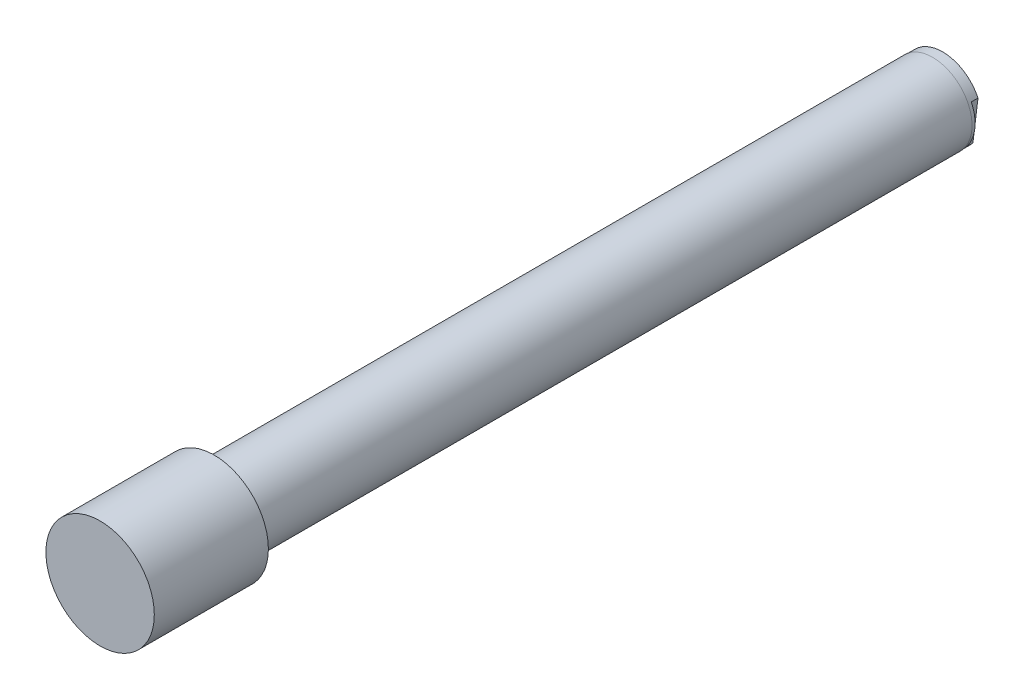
ISO-10303-21;
HEADER;
FILE_DESCRIPTION(('STEP AP214'),'2;1');
FILE_NAME('part.step','',(''),(''),'','','');
FILE_SCHEMA(('AUTOMOTIVE_DESIGN { 1 0 10303 214 1 1 1 1 }'));
ENDSEC;
DATA;
#1=APPLICATION_CONTEXT('core data for automotive mechanical design processes');
#2=APPLICATION_PROTOCOL_DEFINITION('international standard','automotive_design',2000,#1);
#3=PRODUCT_CONTEXT('',#1,'mechanical');
#4=PRODUCT('Part','Part','',(#3));
#5=PRODUCT_RELATED_PRODUCT_CATEGORY('part','',(#4));
#6=PRODUCT_DEFINITION_FORMATION('','',#4);
#7=PRODUCT_DEFINITION_CONTEXT('part definition',#1,'design');
#8=PRODUCT_DEFINITION('design','',#6,#7);
#9=PRODUCT_DEFINITION_SHAPE('','',#8);
#10=(LENGTH_UNIT() NAMED_UNIT(*) SI_UNIT(.MILLI.,.METRE.));
#11=(NAMED_UNIT(*) PLANE_ANGLE_UNIT() SI_UNIT($,.RADIAN.));
#12=(NAMED_UNIT(*) SI_UNIT($,.STERADIAN.) SOLID_ANGLE_UNIT());
#13=UNCERTAINTY_MEASURE_WITH_UNIT(LENGTH_MEASURE(1.E-05),#10,'distance_accuracy_value','');
#14=(GEOMETRIC_REPRESENTATION_CONTEXT(3) GLOBAL_UNCERTAINTY_ASSIGNED_CONTEXT((#13)) GLOBAL_UNIT_ASSIGNED_CONTEXT((#10,
#11,#12)) REPRESENTATION_CONTEXT('',''));
#15=CARTESIAN_POINT('',(0.,0.,0.));
#16=DIRECTION('',(0.,0.,1.));
#17=DIRECTION('',(1.,0.,0.));
#18=AXIS2_PLACEMENT_3D('',#15,#16,#17);
#19=CARTESIAN_POINT('',(0.656038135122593,-5.65517384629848,0.127));
#20=DIRECTION('',(0.,0.,1.));
#21=DIRECTION('',(-0.121869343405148,-0.992546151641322,0.));
#22=AXIS2_PLACEMENT_3D('',#19,#20,#21);
#23=PLANE('',#22);
#24=DIRECTION('',(0.121869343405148,0.992546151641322,0.));
#25=VECTOR('',#24,1.);
#26=CARTESIAN_POINT('',(0.218831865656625,-9.21593316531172,0.127));
#27=LINE('',#26,#25);
#28=CARTESIAN_POINT('',(0.218831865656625,-9.21593316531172,0.127));
#29=VERTEX_POINT('',#28);
#30=CARTESIAN_POINT('',(0.656038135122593,-5.65517384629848,0.127));
#31=VERTEX_POINT('',#30);
#32=EDGE_CURVE('E145',#29,#31,#27,.T.);
#33=ORIENTED_EDGE('',*,*,#32,.F.);
#34=DIRECTION('',(0.999865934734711,-0.016374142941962,0.));
#35=VECTOR('',#34,1.);
#36=CARTESIAN_POINT('',(0.141161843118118,-9.21466121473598,0.127));
#37=LINE('',#36,#35);
#38=CARTESIAN_POINT('',(0.141161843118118,-9.21466121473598,0.127));
#39=VERTEX_POINT('',#38);
#40=EDGE_CURVE('E215',#39,#29,#37,.T.);
#41=ORIENTED_EDGE('',*,*,#40,.F.);
#42=DIRECTION('',(0.229380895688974,-0.973336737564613,0.));
#43=VECTOR('',#42,1.);
#44=CARTESIAN_POINT('',(-0.702419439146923,-5.63507516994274,0.127));
#45=LINE('',#44,#43);
#46=CARTESIAN_POINT('',(-0.702419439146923,-5.63507516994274,0.127));
#47=VERTEX_POINT('',#46);
#48=EDGE_CURVE('E650',#47,#39,#45,.T.);
#49=ORIENTED_EDGE('',*,*,#48,.F.);
#50=DIRECTION('',(0.460532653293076,0.887642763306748,0.));
#51=VECTOR('',#50,1.);
#52=CARTESIAN_POINT('',(-2.39685054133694,-8.90096629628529,0.127));
#53=LINE('',#52,#51);
#54=CARTESIAN_POINT('',(-2.39685054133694,-8.90096629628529,0.127));
#55=VERTEX_POINT('',#54);
#56=EDGE_CURVE('E651',#55,#47,#53,.T.);
#57=ORIENTED_EDGE('',*,*,#56,.F.);
#58=DIRECTION('',(0.97987600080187,-0.199607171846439,0.));
#59=VECTOR('',#58,1.);
#60=CARTESIAN_POINT('',(-2.47344957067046,-8.88536257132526,0.127));
#61=LINE('',#60,#59);
#62=CARTESIAN_POINT('',(-2.47344957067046,-8.88536257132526,0.127));
#63=VERTEX_POINT('',#62);
#64=EDGE_CURVE('E643',#63,#55,#61,.T.);
#65=ORIENTED_EDGE('',*,*,#64,.F.);
#66=DIRECTION('',(-0.121869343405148,-0.992546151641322,0.));
#67=VECTOR('',#66,1.);
#68=CARTESIAN_POINT('',(-2.03624330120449,-5.32460325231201,0.127));
#69=LINE('',#68,#67);
#70=CARTESIAN_POINT('',(-2.03624330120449,-5.32460325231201,0.127));
#71=VERTEX_POINT('',#70);
#72=EDGE_CURVE('E639',#71,#63,#69,.T.);
#73=ORIENTED_EDGE('',*,*,#72,.F.);
#74=DIRECTION('',(-0.992546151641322,0.121869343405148,0.));
#75=VECTOR('',#74,1.);
#76=CARTESIAN_POINT('',(-1.94939551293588,-5.33526681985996,0.127));
#77=LINE('',#76,#75);
#78=CARTESIAN_POINT('',(-1.94939551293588,-5.33526681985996,0.127));
#79=VERTEX_POINT('',#78);
#80=EDGE_CURVE('E656',#79,#71,#77,.T.);
#81=ORIENTED_EDGE('',*,*,#80,.F.);
#82=DIRECTION('',(0.121869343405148,0.992546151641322,0.));
#83=VECTOR('',#82,1.);
#84=CARTESIAN_POINT('',(-2.35344475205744,-8.62598379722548,0.127));
#85=LINE('',#84,#83);
#86=CARTESIAN_POINT('',(-2.35344475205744,-8.62598379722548,0.127));
#87=VERTEX_POINT('',#86);
#88=EDGE_CURVE('E632',#87,#79,#85,.T.);
#89=ORIENTED_EDGE('',*,*,#88,.F.);
#90=DIRECTION('',(-0.460569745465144,-0.88762351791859,0.));
#91=VECTOR('',#90,1.);
#92=CARTESIAN_POINT('',(-0.724027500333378,-5.48572309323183,0.127));
#93=LINE('',#92,#91);
#94=CARTESIAN_POINT('',(-0.724027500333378,-5.48572309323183,0.127));
#95=VERTEX_POINT('',#94);
#96=EDGE_CURVE('E628',#95,#87,#93,.T.);
#97=ORIENTED_EDGE('',*,*,#96,.F.);
#98=DIRECTION('',(-0.992546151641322,0.121869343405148,0.));
#99=VECTOR('',#98,1.);
#100=CARTESIAN_POINT('',(-0.646000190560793,-5.49530364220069,0.127));
#101=LINE('',#100,#99);
#102=CARTESIAN_POINT('',(-0.646000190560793,-5.49530364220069,0.127));
#103=VERTEX_POINT('',#102);
#104=EDGE_CURVE('E660',#103,#95,#101,.T.);
#105=ORIENTED_EDGE('',*,*,#104,.F.);
#106=DIRECTION('',(-0.229507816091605,0.973306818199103,0.));
#107=VECTOR('',#106,1.);
#108=CARTESIAN_POINT('',(0.165141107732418,-8.93522725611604,0.127));
#109=LINE('',#108,#107);
#110=CARTESIAN_POINT('',(0.165141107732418,-8.93522725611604,0.127));
#111=VERTEX_POINT('',#110);
#112=EDGE_CURVE('E662',#111,#103,#109,.T.);
#113=ORIENTED_EDGE('',*,*,#112,.F.);
#114=DIRECTION('',(-0.121869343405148,-0.992546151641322,0.));
#115=VECTOR('',#114,1.);
#116=CARTESIAN_POINT('',(0.569190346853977,-5.64451027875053,0.127));
#117=LINE('',#116,#115);
#118=CARTESIAN_POINT('',(0.569190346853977,-5.64451027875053,0.127));
#119=VERTEX_POINT('',#118);
#120=EDGE_CURVE('E147',#119,#111,#117,.T.);
#121=ORIENTED_EDGE('',*,*,#120,.F.);
#122=DIRECTION('',(-0.992546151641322,0.121869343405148,0.));
#123=VECTOR('',#122,1.);
#124=CARTESIAN_POINT('',(0.656038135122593,-5.65517384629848,0.127));
#125=LINE('',#124,#123);
#126=EDGE_CURVE('E142',#31,#119,#125,.T.);
#127=ORIENTED_EDGE('',*,*,#126,.F.);
#128=EDGE_LOOP('',(#33,#41,#49,#57,#65,#73,#81,#89,#97,#105,#113,#121,#127));
#129=FACE_BOUND('',#128,.T.);
#130=ADVANCED_FACE('F16',(#129),#23,.F.);
#131=CARTESIAN_POINT('',(0.,0.,25.4));
#132=DIRECTION('',(0.,0.,-1.));
#133=DIRECTION('',(0.121869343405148,0.992546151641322,0.));
#134=AXIS2_PLACEMENT_3D('',#131,#132,#133);
#135=CONICAL_SURFACE('',#134,4.4,1.02974425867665);
#136=CARTESIAN_POINT('',(0.,0.,28.0437867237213));
#137=VERTEX_POINT('',#136);
#138=VERTEX_LOOP('',#137);
#139=FACE_BOUND('',#138,.T.);
#140=CARTESIAN_POINT('',(0.,0.,25.4));
#141=DIRECTION('',(0.,0.,-1.));
#142=DIRECTION('',(0.121869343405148,0.992546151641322,0.));
#143=AXIS2_PLACEMENT_3D('',#140,#141,#142);
#144=CIRCLE('',#143,4.4);
#145=CARTESIAN_POINT('',(0.536225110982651,4.36720306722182,25.4));
#146=VERTEX_POINT('',#145);
#147=EDGE_CURVE('E187',#146,#146,#144,.T.);
#148=ORIENTED_EDGE('',*,*,#147,.T.);
#149=EDGE_LOOP('',(#148));
#150=FACE_BOUND('',#149,.T.);
#151=ADVANCED_FACE('F297',(#139,#150),#135,.F.);
#152=CARTESIAN_POINT('',(0.141161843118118,-9.21466121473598,0.127));
#153=DIRECTION('',(0.016374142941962,0.99986593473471,0.));
#154=DIRECTION('',(-0.999865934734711,0.016374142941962,0.));
#155=AXIS2_PLACEMENT_3D('',#152,#153,#154);
#156=PLANE('',#155);
#157=DIRECTION('',(0.999865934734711,-0.016374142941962,0.));
#158=VECTOR('',#157,1.);
#159=CARTESIAN_POINT('',(0.141161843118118,-9.21466121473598,0.));
#160=LINE('',#159,#158);
#161=CARTESIAN_POINT('',(0.141161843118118,-9.21466121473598,0.));
#162=VERTEX_POINT('',#161);
#163=CARTESIAN_POINT('',(0.218831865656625,-9.21593316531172,0.));
#164=VERTEX_POINT('',#163);
#165=EDGE_CURVE('E155',#162,#164,#160,.T.);
#166=ORIENTED_EDGE('',*,*,#165,.F.);
#167=DIRECTION('',(0.,0.,-1.));
#168=VECTOR('',#167,1.);
#169=CARTESIAN_POINT('',(0.141161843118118,-9.21466121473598,0.127));
#170=LINE('',#169,#168);
#171=EDGE_CURVE('E249',#39,#162,#170,.T.);
#172=ORIENTED_EDGE('',*,*,#171,.F.);
#173=ORIENTED_EDGE('',*,*,#40,.T.);
#174=DIRECTION('',(0.,0.,-1.));
#175=VECTOR('',#174,1.);
#176=CARTESIAN_POINT('',(0.218831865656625,-9.21593316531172,0.127));
#177=LINE('',#176,#175);
#178=EDGE_CURVE('E154',#29,#164,#177,.T.);
#179=ORIENTED_EDGE('',*,*,#178,.T.);
#180=EDGE_LOOP('',(#166,#172,#173,#179));
#181=FACE_BOUND('',#180,.T.);
#182=ADVANCED_FACE('F303',(#181),#156,.T.);
#183=CARTESIAN_POINT('',(-0.702419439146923,-5.63507516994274,0.127));
#184=DIRECTION('',(0.973336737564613,0.229380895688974,0.));
#185=DIRECTION('',(-0.229380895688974,0.973336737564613,0.));
#186=AXIS2_PLACEMENT_3D('',#183,#184,#185);
#187=PLANE('',#186);
#188=DIRECTION('',(0.229380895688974,-0.973336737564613,0.));
#189=VECTOR('',#188,1.);
#190=CARTESIAN_POINT('',(-0.702419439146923,-5.63507516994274,0.));
#191=LINE('',#190,#189);
#192=CARTESIAN_POINT('',(-0.702419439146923,-5.63507516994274,0.));
#193=VERTEX_POINT('',#192);
#194=EDGE_CURVE('E244',#193,#162,#191,.T.);
#195=ORIENTED_EDGE('',*,*,#194,.F.);
#196=DIRECTION('',(0.,0.,-1.));
#197=VECTOR('',#196,1.);
#198=CARTESIAN_POINT('',(-0.702419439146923,-5.63507516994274,0.127));
#199=LINE('',#198,#197);
#200=EDGE_CURVE('E251',#47,#193,#199,.T.);
#201=ORIENTED_EDGE('',*,*,#200,.F.);
#202=ORIENTED_EDGE('',*,*,#48,.T.);
#203=ORIENTED_EDGE('',*,*,#171,.T.);
#204=EDGE_LOOP('',(#195,#201,#202,#203));
#205=FACE_BOUND('',#204,.T.);
#206=ADVANCED_FACE('F309',(#205),#187,.T.);
#207=CARTESIAN_POINT('',(-2.39685054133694,-8.90096629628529,0.127));
#208=DIRECTION('',(-0.887642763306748,0.460532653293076,0.));
#209=DIRECTION('',(-0.460532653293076,-0.887642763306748,0.));
#210=AXIS2_PLACEMENT_3D('',#207,#208,#209);
#211=PLANE('',#210);
#212=DIRECTION('',(0.460532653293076,0.887642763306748,0.));
#213=VECTOR('',#212,1.);
#214=CARTESIAN_POINT('',(-2.39685054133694,-8.90096629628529,0.));
#215=LINE('',#214,#213);
#216=CARTESIAN_POINT('',(-2.39685054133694,-8.90096629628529,0.));
#217=VERTEX_POINT('',#216);
#218=EDGE_CURVE('E241',#217,#193,#215,.T.);
#219=ORIENTED_EDGE('',*,*,#218,.F.);
#220=DIRECTION('',(0.,0.,-1.));
#221=VECTOR('',#220,1.);
#222=CARTESIAN_POINT('',(-2.39685054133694,-8.90096629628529,0.127));
#223=LINE('',#222,#221);
#224=EDGE_CURVE('E253',#55,#217,#223,.T.);
#225=ORIENTED_EDGE('',*,*,#224,.F.);
#226=ORIENTED_EDGE('',*,*,#56,.T.);
#227=ORIENTED_EDGE('',*,*,#200,.T.);
#228=EDGE_LOOP('',(#219,#225,#226,#227));
#229=FACE_BOUND('',#228,.T.);
#230=ADVANCED_FACE('F313',(#229),#211,.T.);
#231=CARTESIAN_POINT('',(-2.47344957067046,-8.88536257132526,0.127));
#232=DIRECTION('',(0.199607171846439,0.97987600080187,0.));
#233=DIRECTION('',(-0.97987600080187,0.199607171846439,0.));
#234=AXIS2_PLACEMENT_3D('',#231,#232,#233);
#235=PLANE('',#234);
#236=DIRECTION('',(0.97987600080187,-0.199607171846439,0.));
#237=VECTOR('',#236,1.);
#238=CARTESIAN_POINT('',(-2.47344957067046,-8.88536257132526,0.));
#239=LINE('',#238,#237);
#240=CARTESIAN_POINT('',(-2.47344957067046,-8.88536257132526,0.));
#241=VERTEX_POINT('',#240);
#242=EDGE_CURVE('E238',#241,#217,#239,.T.);
#243=ORIENTED_EDGE('',*,*,#242,.F.);
#244=DIRECTION('',(0.,0.,-1.));
#245=VECTOR('',#244,1.);
#246=CARTESIAN_POINT('',(-2.47344957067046,-8.88536257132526,0.127));
#247=LINE('',#246,#245);
#248=EDGE_CURVE('E255',#63,#241,#247,.T.);
#249=ORIENTED_EDGE('',*,*,#248,.F.);
#250=ORIENTED_EDGE('',*,*,#64,.T.);
#251=ORIENTED_EDGE('',*,*,#224,.T.);
#252=EDGE_LOOP('',(#243,#249,#250,#251));
#253=FACE_BOUND('',#252,.T.);
#254=ADVANCED_FACE('F317',(#253),#235,.T.);
#255=CARTESIAN_POINT('',(-2.03624330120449,-5.32460325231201,0.127));
#256=DIRECTION('',(0.992546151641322,-0.121869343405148,0.));
#257=DIRECTION('',(0.121869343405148,0.992546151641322,0.));
#258=AXIS2_PLACEMENT_3D('',#255,#256,#257);
#259=PLANE('',#258);
#260=DIRECTION('',(-0.121869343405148,-0.992546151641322,0.));
#261=VECTOR('',#260,1.);
#262=CARTESIAN_POINT('',(-2.03624330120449,-5.32460325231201,0.));
#263=LINE('',#262,#261);
#264=CARTESIAN_POINT('',(-2.03624330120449,-5.32460325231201,0.));
#265=VERTEX_POINT('',#264);
#266=EDGE_CURVE('E235',#265,#241,#263,.T.);
#267=ORIENTED_EDGE('',*,*,#266,.F.);
#268=DIRECTION('',(0.,0.,-1.));
#269=VECTOR('',#268,1.);
#270=CARTESIAN_POINT('',(-2.03624330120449,-5.32460325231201,0.127));
#271=LINE('',#270,#269);
#272=EDGE_CURVE('E257',#71,#265,#271,.T.);
#273=ORIENTED_EDGE('',*,*,#272,.F.);
#274=ORIENTED_EDGE('',*,*,#72,.T.);
#275=ORIENTED_EDGE('',*,*,#248,.T.);
#276=EDGE_LOOP('',(#267,#273,#274,#275));
#277=FACE_BOUND('',#276,.T.);
#278=ADVANCED_FACE('F321',(#277),#259,.T.);
#279=CARTESIAN_POINT('',(-1.94939551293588,-5.33526681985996,0.127));
#280=DIRECTION('',(-0.121869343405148,-0.992546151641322,0.));
#281=DIRECTION('',(0.,0.,-1.));
#282=AXIS2_PLACEMENT_3D('',#279,#280,#281);
#283=PLANE('',#282);
#284=DIRECTION('',(-0.992546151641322,0.121869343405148,0.));
#285=VECTOR('',#284,1.);
#286=CARTESIAN_POINT('',(-1.94939551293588,-5.33526681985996,0.));
#287=LINE('',#286,#285);
#288=CARTESIAN_POINT('',(-1.94939551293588,-5.33526681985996,0.));
#289=VERTEX_POINT('',#288);
#290=EDGE_CURVE('E232',#289,#265,#287,.T.);
#291=ORIENTED_EDGE('',*,*,#290,.F.);
#292=DIRECTION('',(0.,0.,-1.));
#293=VECTOR('',#292,1.);
#294=CARTESIAN_POINT('',(-1.94939551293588,-5.33526681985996,0.127));
#295=LINE('',#294,#293);
#296=EDGE_CURVE('E259',#79,#289,#295,.T.);
#297=ORIENTED_EDGE('',*,*,#296,.F.);
#298=ORIENTED_EDGE('',*,*,#80,.T.);
#299=ORIENTED_EDGE('',*,*,#272,.T.);
#300=EDGE_LOOP('',(#291,#297,#298,#299));
#301=FACE_BOUND('',#300,.T.);
#302=ADVANCED_FACE('F325',(#301),#283,.T.);
#303=CARTESIAN_POINT('',(-2.35344475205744,-8.62598379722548,0.127));
#304=DIRECTION('',(-0.992546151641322,0.121869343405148,0.));
#305=DIRECTION('',(-0.121869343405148,-0.992546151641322,0.));
#306=AXIS2_PLACEMENT_3D('',#303,#304,#305);
#307=PLANE('',#306);
#308=DIRECTION('',(0.121869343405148,0.992546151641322,0.));
#309=VECTOR('',#308,1.);
#310=CARTESIAN_POINT('',(-2.35344475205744,-8.62598379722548,0.));
#311=LINE('',#310,#309);
#312=CARTESIAN_POINT('',(-2.35344475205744,-8.62598379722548,0.));
#313=VERTEX_POINT('',#312);
#314=EDGE_CURVE('E229',#313,#289,#311,.T.);
#315=ORIENTED_EDGE('',*,*,#314,.F.);
#316=DIRECTION('',(0.,0.,-1.));
#317=VECTOR('',#316,1.);
#318=CARTESIAN_POINT('',(-2.35344475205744,-8.62598379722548,0.127));
#319=LINE('',#318,#317);
#320=EDGE_CURVE('E261',#87,#313,#319,.T.);
#321=ORIENTED_EDGE('',*,*,#320,.F.);
#322=ORIENTED_EDGE('',*,*,#88,.T.);
#323=ORIENTED_EDGE('',*,*,#296,.T.);
#324=EDGE_LOOP('',(#315,#321,#322,#323));
#325=FACE_BOUND('',#324,.T.);
#326=ADVANCED_FACE('F329',(#325),#307,.T.);
#327=CARTESIAN_POINT('',(-0.724027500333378,-5.48572309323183,0.127));
#328=DIRECTION('',(0.88762351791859,-0.460569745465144,0.));
#329=DIRECTION('',(0.460569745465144,0.88762351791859,0.));
#330=AXIS2_PLACEMENT_3D('',#327,#328,#329);
#331=PLANE('',#330);
#332=DIRECTION('',(-0.460569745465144,-0.88762351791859,0.));
#333=VECTOR('',#332,1.);
#334=CARTESIAN_POINT('',(-0.724027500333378,-5.48572309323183,0.));
#335=LINE('',#334,#333);
#336=CARTESIAN_POINT('',(-0.724027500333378,-5.48572309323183,0.));
#337=VERTEX_POINT('',#336);
#338=EDGE_CURVE('E226',#337,#313,#335,.T.);
#339=ORIENTED_EDGE('',*,*,#338,.F.);
#340=DIRECTION('',(0.,0.,-1.));
#341=VECTOR('',#340,1.);
#342=CARTESIAN_POINT('',(-0.724027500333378,-5.48572309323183,0.127));
#343=LINE('',#342,#341);
#344=EDGE_CURVE('E263',#95,#337,#343,.T.);
#345=ORIENTED_EDGE('',*,*,#344,.F.);
#346=ORIENTED_EDGE('',*,*,#96,.T.);
#347=ORIENTED_EDGE('',*,*,#320,.T.);
#348=EDGE_LOOP('',(#339,#345,#346,#347));
#349=FACE_BOUND('',#348,.T.);
#350=ADVANCED_FACE('F333',(#349),#331,.T.);
#351=CARTESIAN_POINT('',(-0.646000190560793,-5.49530364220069,0.127));
#352=DIRECTION('',(-0.121869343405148,-0.992546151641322,0.));
#353=DIRECTION('',(0.,0.,-1.));
#354=AXIS2_PLACEMENT_3D('',#351,#352,#353);
#355=PLANE('',#354);
#356=DIRECTION('',(-0.992546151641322,0.121869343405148,0.));
#357=VECTOR('',#356,1.);
#358=CARTESIAN_POINT('',(-0.646000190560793,-5.49530364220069,0.));
#359=LINE('',#358,#357);
#360=CARTESIAN_POINT('',(-0.646000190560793,-5.49530364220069,0.));
#361=VERTEX_POINT('',#360);
#362=EDGE_CURVE('E223',#361,#337,#359,.T.);
#363=ORIENTED_EDGE('',*,*,#362,.F.);
#364=DIRECTION('',(0.,0.,-1.));
#365=VECTOR('',#364,1.);
#366=CARTESIAN_POINT('',(-0.646000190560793,-5.49530364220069,0.127));
#367=LINE('',#366,#365);
#368=EDGE_CURVE('E265',#103,#361,#367,.T.);
#369=ORIENTED_EDGE('',*,*,#368,.F.);
#370=ORIENTED_EDGE('',*,*,#104,.T.);
#371=ORIENTED_EDGE('',*,*,#344,.T.);
#372=EDGE_LOOP('',(#363,#369,#370,#371));
#373=FACE_BOUND('',#372,.T.);
#374=ADVANCED_FACE('F337',(#373),#355,.T.);
#375=CARTESIAN_POINT('',(0.165141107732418,-8.93522725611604,0.127));
#376=DIRECTION('',(-0.973306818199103,-0.229507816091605,0.));
#377=DIRECTION('',(0.229507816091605,-0.973306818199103,0.));
#378=AXIS2_PLACEMENT_3D('',#375,#376,#377);
#379=PLANE('',#378);
#380=DIRECTION('',(-0.229507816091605,0.973306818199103,0.));
#381=VECTOR('',#380,1.);
#382=CARTESIAN_POINT('',(0.165141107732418,-8.93522725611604,0.));
#383=LINE('',#382,#381);
#384=CARTESIAN_POINT('',(0.165141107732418,-8.93522725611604,0.));
#385=VERTEX_POINT('',#384);
#386=EDGE_CURVE('E220',#385,#361,#383,.T.);
#387=ORIENTED_EDGE('',*,*,#386,.F.);
#388=DIRECTION('',(0.,0.,-1.));
#389=VECTOR('',#388,1.);
#390=CARTESIAN_POINT('',(0.165141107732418,-8.93522725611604,0.127));
#391=LINE('',#390,#389);
#392=EDGE_CURVE('E165',#111,#385,#391,.T.);
#393=ORIENTED_EDGE('',*,*,#392,.F.);
#394=ORIENTED_EDGE('',*,*,#112,.T.);
#395=ORIENTED_EDGE('',*,*,#368,.T.);
#396=EDGE_LOOP('',(#387,#393,#394,#395));
#397=FACE_BOUND('',#396,.T.);
#398=ADVANCED_FACE('F272',(#397),#379,.T.);
#399=CARTESIAN_POINT('',(0.569190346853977,-5.64451027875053,0.127));
#400=DIRECTION('',(0.992546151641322,-0.121869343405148,0.));
#401=DIRECTION('',(0.121869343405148,0.992546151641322,0.));
#402=AXIS2_PLACEMENT_3D('',#399,#400,#401);
#403=PLANE('',#402);
#404=DIRECTION('',(-0.121869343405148,-0.992546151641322,0.));
#405=VECTOR('',#404,1.);
#406=CARTESIAN_POINT('',(0.569190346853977,-5.64451027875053,0.));
#407=LINE('',#406,#405);
#408=CARTESIAN_POINT('',(0.569190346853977,-5.64451027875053,0.));
#409=VERTEX_POINT('',#408);
#410=EDGE_CURVE('E212',#409,#385,#407,.T.);
#411=ORIENTED_EDGE('',*,*,#410,.F.);
#412=DIRECTION('',(0.,0.,-1.));
#413=VECTOR('',#412,1.);
#414=CARTESIAN_POINT('',(0.569190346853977,-5.64451027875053,0.127));
#415=LINE('',#414,#413);
#416=EDGE_CURVE('E161',#119,#409,#415,.T.);
#417=ORIENTED_EDGE('',*,*,#416,.F.);
#418=ORIENTED_EDGE('',*,*,#120,.T.);
#419=ORIENTED_EDGE('',*,*,#392,.T.);
#420=EDGE_LOOP('',(#411,#417,#418,#419));
#421=FACE_BOUND('',#420,.T.);
#422=ADVANCED_FACE('F270',(#421),#403,.T.);
#423=CARTESIAN_POINT('',(0.656038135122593,-5.65517384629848,0.127));
#424=DIRECTION('',(-0.121869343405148,-0.992546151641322,0.));
#425=DIRECTION('',(0.,0.,-1.));
#426=AXIS2_PLACEMENT_3D('',#423,#424,#425);
#427=PLANE('',#426);
#428=DIRECTION('',(-0.992546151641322,0.121869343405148,0.));
#429=VECTOR('',#428,1.);
#430=CARTESIAN_POINT('',(0.656038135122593,-5.65517384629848,0.));
#431=LINE('',#430,#429);
#432=CARTESIAN_POINT('',(0.656038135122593,-5.65517384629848,0.));
#433=VERTEX_POINT('',#432);
#434=EDGE_CURVE('E159',#433,#409,#431,.T.);
#435=ORIENTED_EDGE('',*,*,#434,.F.);
#436=DIRECTION('',(0.,0.,-1.));
#437=VECTOR('',#436,1.);
#438=CARTESIAN_POINT('',(0.656038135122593,-5.65517384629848,0.127));
#439=LINE('',#438,#437);
#440=EDGE_CURVE('E153',#31,#433,#439,.T.);
#441=ORIENTED_EDGE('',*,*,#440,.F.);
#442=ORIENTED_EDGE('',*,*,#126,.T.);
#443=ORIENTED_EDGE('',*,*,#416,.T.);
#444=EDGE_LOOP('',(#435,#441,#442,#443));
#445=FACE_BOUND('',#444,.T.);
#446=ADVANCED_FACE('F157',(#445),#427,.T.);
#447=CARTESIAN_POINT('',(0.218831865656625,-9.21593316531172,0.127));
#448=DIRECTION('',(-0.992546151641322,0.121869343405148,0.));
#449=DIRECTION('',(-0.121869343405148,-0.992546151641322,0.));
#450=AXIS2_PLACEMENT_3D('',#447,#448,#449);
#451=PLANE('',#450);
#452=DIRECTION('',(0.121869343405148,0.992546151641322,0.));
#453=VECTOR('',#452,1.);
#454=CARTESIAN_POINT('',(0.218831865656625,-9.21593316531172,0.));
#455=LINE('',#454,#453);
#456=EDGE_CURVE('E33',#164,#433,#455,.T.);
#457=ORIENTED_EDGE('',*,*,#456,.F.);
#458=ORIENTED_EDGE('',*,*,#178,.F.);
#459=ORIENTED_EDGE('',*,*,#32,.T.);
#460=ORIENTED_EDGE('',*,*,#440,.T.);
#461=EDGE_LOOP('',(#457,#458,#459,#460));
#462=FACE_BOUND('',#461,.T.);
#463=ADVANCED_FACE('F152',(#462),#451,.T.);
#464=CARTESIAN_POINT('',(0.,0.,0.));
#465=DIRECTION('',(0.,0.,-1.));
#466=DIRECTION('',(0.121869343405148,0.992546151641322,0.));
#467=AXIS2_PLACEMENT_3D('',#464,#465,#466);
#468=CYLINDRICAL_SURFACE('',#467,4.4);
#469=ORIENTED_EDGE('',*,*,#147,.F.);
#470=EDGE_LOOP('',(#469));
#471=FACE_BOUND('',#470,.T.);
#472=CARTESIAN_POINT('',(0.,0.,0.));
#473=DIRECTION('',(0.,0.,-1.));
#474=DIRECTION('',(0.121869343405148,0.992546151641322,0.));
#475=AXIS2_PLACEMENT_3D('',#472,#473,#474);
#476=CIRCLE('',#475,4.4);
#477=CARTESIAN_POINT('',(0.53622511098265,4.36720306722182,0.));
#478=VERTEX_POINT('',#477);
#479=EDGE_CURVE('E191',#478,#478,#476,.T.);
#480=ORIENTED_EDGE('',*,*,#479,.T.);
#481=EDGE_LOOP('',(#480));
#482=FACE_BOUND('',#481,.T.);
#483=ADVANCED_FACE('F350',(#471,#482),#468,.F.);
#484=CARTESIAN_POINT('',(0.,0.,2.54));
#485=DIRECTION('',(0.,0.,-1.));
#486=DIRECTION('',(0.121869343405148,0.992546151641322,0.));
#487=AXIS2_PLACEMENT_3D('',#484,#485,#486);
#488=PLANE('',#487);
#489=CARTESIAN_POINT('',(0.,0.,2.54));
#490=DIRECTION('',(0.,0.,-1.));
#491=DIRECTION('',(0.121869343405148,0.992546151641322,0.));
#492=AXIS2_PLACEMENT_3D('',#489,#490,#491);
#493=CIRCLE('',#492,14.8844);
#494=CARTESIAN_POINT('',(-13.4501542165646,-6.37485018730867,2.54));
#495=VERTEX_POINT('',#494);
#496=CARTESIAN_POINT('',(-11.5084113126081,9.43937669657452,2.54));
#497=VERTEX_POINT('',#496);
#498=EDGE_CURVE('E177',#495,#497,#493,.T.);
#499=ORIENTED_EDGE('',*,*,#498,.T.);
#500=DIRECTION('',(-0.121869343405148,-0.992546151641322,0.));
#501=VECTOR('',#500,1.);
#502=CARTESIAN_POINT('',(-13.4501542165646,-6.37485018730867,2.54));
#503=LINE('',#502,#501);
#504=EDGE_CURVE('E179',#497,#495,#503,.T.);
#505=ORIENTED_EDGE('',*,*,#504,.T.);
#506=EDGE_LOOP('',(#499,#505));
#507=FACE_BOUND('',#506,.T.);
#508=ADVANCED_FACE('F290',(#507),#488,.T.);
#509=CARTESIAN_POINT('',(-13.4501542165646,-6.37485018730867,2.54));
#510=DIRECTION('',(0.992546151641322,-0.121869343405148,0.));
#511=DIRECTION('',(0.121869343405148,0.992546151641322,0.));
#512=AXIS2_PLACEMENT_3D('',#509,#510,#511);
#513=PLANE('',#512);
#514=DIRECTION('',(-0.121869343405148,-0.992546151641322,0.));
#515=VECTOR('',#514,1.);
#516=CARTESIAN_POINT('',(-13.4501542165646,-6.37485018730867,0.));
#517=LINE('',#516,#515);
#518=CARTESIAN_POINT('',(-11.5084113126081,9.43937669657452,0.));
#519=VERTEX_POINT('',#518);
#520=CARTESIAN_POINT('',(-13.4501542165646,-6.37485018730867,0.));
#521=VERTEX_POINT('',#520);
#522=EDGE_CURVE('E175',#519,#521,#517,.T.);
#523=ORIENTED_EDGE('',*,*,#522,.T.);
#524=DIRECTION('',(0.,0.,-1.));
#525=VECTOR('',#524,1.);
#526=CARTESIAN_POINT('',(-13.4501542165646,-6.37485018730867,2.54));
#527=LINE('',#526,#525);
#528=EDGE_CURVE('E184',#495,#521,#527,.T.);
#529=ORIENTED_EDGE('',*,*,#528,.F.);
#530=ORIENTED_EDGE('',*,*,#504,.F.);
#531=DIRECTION('',(0.,0.,-1.));
#532=VECTOR('',#531,1.);
#533=CARTESIAN_POINT('',(-11.5084113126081,9.43937669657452,2.54));
#534=LINE('',#533,#532);
#535=EDGE_CURVE('E181',#497,#519,#534,.T.);
#536=ORIENTED_EDGE('',*,*,#535,.T.);
#537=EDGE_LOOP('',(#523,#529,#530,#536));
#538=FACE_BOUND('',#537,.T.);
#539=ADVANCED_FACE('F278',(#538),#513,.F.);
#540=CARTESIAN_POINT('',(0.,0.,0.));
#541=DIRECTION('',(0.,0.,1.));
#542=DIRECTION('',(-0.121869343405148,-0.992546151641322,0.));
#543=AXIS2_PLACEMENT_3D('',#540,#541,#542);
#544=PLANE('',#543);
#545=CARTESIAN_POINT('',(0.,0.,0.));
#546=DIRECTION('',(0.,0.,-1.));
#547=DIRECTION('',(0.121869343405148,0.992546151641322,0.));
#548=AXIS2_PLACEMENT_3D('',#545,#546,#547);
#549=CIRCLE('',#548,14.8844);
#550=CARTESIAN_POINT('',(13.4501542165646,6.37485018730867,0.));
#551=VERTEX_POINT('',#550);
#552=EDGE_CURVE('E10',#519,#551,#549,.T.);
#553=ORIENTED_EDGE('',*,*,#552,.T.);
#554=DIRECTION('',(0.121869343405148,0.992546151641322,0.));
#555=VECTOR('',#554,1.);
#556=CARTESIAN_POINT('',(11.5084113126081,-9.43937669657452,0.));
#557=LINE('',#556,#555);
#558=CARTESIAN_POINT('',(11.5084113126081,-9.43937669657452,0.));
#559=VERTEX_POINT('',#558);
#560=EDGE_CURVE('E160',#559,#551,#557,.T.);
#561=ORIENTED_EDGE('',*,*,#560,.F.);
#562=EDGE_CURVE('E25',#559,#521,#549,.T.);
#563=ORIENTED_EDGE('',*,*,#562,.T.);
#564=ORIENTED_EDGE('',*,*,#522,.F.);
#565=EDGE_LOOP('',(#553,#561,#563,#564));
#566=FACE_BOUND('',#565,.T.);
#567=ORIENTED_EDGE('',*,*,#479,.F.);
#568=EDGE_LOOP('',(#567));
#569=FACE_BOUND('',#568,.T.);
#570=ORIENTED_EDGE('',*,*,#456,.T.);
#571=ORIENTED_EDGE('',*,*,#434,.T.);
#572=ORIENTED_EDGE('',*,*,#410,.T.);
#573=ORIENTED_EDGE('',*,*,#386,.T.);
#574=ORIENTED_EDGE('',*,*,#362,.T.);
#575=ORIENTED_EDGE('',*,*,#338,.T.);
#576=ORIENTED_EDGE('',*,*,#314,.T.);
#577=ORIENTED_EDGE('',*,*,#290,.T.);
#578=ORIENTED_EDGE('',*,*,#266,.T.);
#579=ORIENTED_EDGE('',*,*,#242,.T.);
#580=ORIENTED_EDGE('',*,*,#218,.T.);
#581=ORIENTED_EDGE('',*,*,#194,.T.);
#582=ORIENTED_EDGE('',*,*,#165,.T.);
#583=EDGE_LOOP('',(#570,#571,#572,#573,#574,#575,#576,#577,#578,#579,#580,#581,#582));
#584=FACE_BOUND('',#583,.T.);
#585=ADVANCED_FACE('F275',(#566,#569,#584),#544,.F.);
#586=CARTESIAN_POINT('',(11.5084113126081,-9.43937669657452,2.54));
#587=DIRECTION('',(-0.992546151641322,0.121869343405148,0.));
#588=DIRECTION('',(-0.121869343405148,-0.992546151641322,0.));
#589=AXIS2_PLACEMENT_3D('',#586,#587,#588);
#590=PLANE('',#589);
#591=ORIENTED_EDGE('',*,*,#560,.T.);
#592=DIRECTION('',(0.,0.,-1.));
#593=VECTOR('',#592,1.);
#594=CARTESIAN_POINT('',(13.4501542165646,6.37485018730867,2.54));
#595=LINE('',#594,#593);
#596=CARTESIAN_POINT('',(13.4501542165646,6.37485018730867,2.54));
#597=VERTEX_POINT('',#596);
#598=EDGE_CURVE('E172',#597,#551,#595,.T.);
#599=ORIENTED_EDGE('',*,*,#598,.F.);
#600=DIRECTION('',(0.121869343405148,0.992546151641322,0.));
#601=VECTOR('',#600,1.);
#602=CARTESIAN_POINT('',(11.5084113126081,-9.43937669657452,2.54));
#603=LINE('',#602,#601);
#604=CARTESIAN_POINT('',(11.5084113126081,-9.43937669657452,2.54));
#605=VERTEX_POINT('',#604);
#606=EDGE_CURVE('E40',#605,#597,#603,.T.);
#607=ORIENTED_EDGE('',*,*,#606,.F.);
#608=DIRECTION('',(0.,0.,-1.));
#609=VECTOR('',#608,1.);
#610=CARTESIAN_POINT('',(11.5084113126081,-9.43937669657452,2.54));
#611=LINE('',#610,#609);
#612=EDGE_CURVE('E170',#605,#559,#611,.T.);
#613=ORIENTED_EDGE('',*,*,#612,.T.);
#614=EDGE_LOOP('',(#591,#599,#607,#613));
#615=FACE_BOUND('',#614,.T.);
#616=ADVANCED_FACE('F277',(#615),#590,.F.);
#617=CARTESIAN_POINT('',(0.,0.,2.54));
#618=DIRECTION('',(0.,0.,-1.));
#619=DIRECTION('',(0.121869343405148,0.992546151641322,0.));
#620=AXIS2_PLACEMENT_3D('',#617,#618,#619);
#621=PLANE('',#620);
#622=CARTESIAN_POINT('',(0.,0.,2.54));
#623=DIRECTION('',(0.,0.,-1.));
#624=DIRECTION('',(0.121869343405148,0.992546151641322,0.));
#625=AXIS2_PLACEMENT_3D('',#622,#623,#624);
#626=CIRCLE('',#625,14.8844);
#627=EDGE_CURVE('E163',#597,#605,#626,.T.);
#628=ORIENTED_EDGE('',*,*,#627,.T.);
#629=ORIENTED_EDGE('',*,*,#606,.T.);
#630=EDGE_LOOP('',(#628,#629));
#631=FACE_BOUND('',#630,.T.);
#632=ADVANCED_FACE('F287',(#631),#621,.T.);
#633=CARTESIAN_POINT('',(0.,0.,-0.994542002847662));
#634=DIRECTION('',(0.,0.,-1.));
#635=DIRECTION('',(0.121869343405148,0.992546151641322,0.));
#636=AXIS2_PLACEMENT_3D('',#633,#634,#635);
#637=CYLINDRICAL_SURFACE('',#636,14.8844);
#638=ORIENTED_EDGE('',*,*,#627,.F.);
#639=ORIENTED_EDGE('',*,*,#598,.T.);
#640=ORIENTED_EDGE('',*,*,#552,.F.);
#641=ORIENTED_EDGE('',*,*,#535,.F.);
#642=ORIENTED_EDGE('',*,*,#498,.F.);
#643=ORIENTED_EDGE('',*,*,#528,.T.);
#644=ORIENTED_EDGE('',*,*,#562,.F.);
#645=ORIENTED_EDGE('',*,*,#612,.F.);
#646=EDGE_LOOP('',(#638,#639,#640,#641,#642,#643,#644,#645));
#647=FACE_BOUND('',#646,.T.);
#648=CARTESIAN_POINT('',(0.,0.,3.81));
#649=DIRECTION('',(0.,0.,-1.));
#650=DIRECTION('',(0.121869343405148,0.992546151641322,0.));
#651=AXIS2_PLACEMENT_3D('',#648,#649,#650);
#652=CIRCLE('',#651,14.8844);
#653=CARTESIAN_POINT('',(1.81395205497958,14.7734539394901,3.81));
#654=VERTEX_POINT('',#653);
#655=EDGE_CURVE('E194',#654,#654,#652,.T.);
#656=ORIENTED_EDGE('',*,*,#655,.T.);
#657=EDGE_LOOP('',(#656));
#658=FACE_BOUND('',#657,.T.);
#659=ADVANCED_FACE('F352',(#647,#658),#637,.T.);
#660=CARTESIAN_POINT('',(0.,9.33552867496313E-13,320.802));
#661=DIRECTION('',(0.,0.,1.));
#662=DIRECTION('',(1.,0.,0.));
#663=AXIS2_PLACEMENT_3D('',#660,#661,#662);
#664=PLANE('',#663);
#665=CARTESIAN_POINT('',(0.,9.33552867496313E-13,320.802));
#666=DIRECTION('',(0.,0.,1.));
#667=DIRECTION('',(1.,0.,0.));
#668=AXIS2_PLACEMENT_3D('',#665,#666,#667);
#669=CIRCLE('',#668,20.6375);
#670=CARTESIAN_POINT('',(20.6375,9.33660268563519E-13,320.802));
#671=VERTEX_POINT('',#670);
#672=EDGE_CURVE('E197',#671,#671,#669,.T.);
#673=ORIENTED_EDGE('',*,*,#672,.T.);
#674=EDGE_LOOP('',(#673));
#675=FACE_BOUND('',#674,.T.);
#676=ADVANCED_FACE('F360',(#675),#664,.T.);
#677=CARTESIAN_POINT('',(0.,9.33552867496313E-13,320.802));
#678=DIRECTION('',(0.,0.,-1.));
#679=DIRECTION('',(-1.,0.,0.));
#680=AXIS2_PLACEMENT_3D('',#677,#678,#679);
#681=CYLINDRICAL_SURFACE('',#680,20.6375);
#682=ORIENTED_EDGE('',*,*,#672,.F.);
#683=EDGE_LOOP('',(#682));
#684=FACE_BOUND('',#683,.T.);
#685=CARTESIAN_POINT('',(0.,9.33854241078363E-13,277.368));
#686=DIRECTION('',(0.,0.,1.));
#687=DIRECTION('',(1.,0.,0.));
#688=AXIS2_PLACEMENT_3D('',#685,#686,#687);
#689=CIRCLE('',#688,20.6375);
#690=CARTESIAN_POINT('',(20.6375,9.33961642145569E-13,277.368));
#691=VERTEX_POINT('',#690);
#692=EDGE_CURVE('E201',#691,#691,#689,.T.);
#693=ORIENTED_EDGE('',*,*,#692,.T.);
#694=EDGE_LOOP('',(#693));
#695=FACE_BOUND('',#694,.T.);
#696=ADVANCED_FACE('F366',(#684,#695),#681,.T.);
#697=CARTESIAN_POINT('',(0.,9.33854241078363E-13,277.368));
#698=DIRECTION('',(0.,0.,1.));
#699=DIRECTION('',(1.,0.,0.));
#700=AXIS2_PLACEMENT_3D('',#697,#698,#699);
#701=PLANE('',#700);
#702=CARTESIAN_POINT('',(0.,9.33854241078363E-13,277.368));
#703=DIRECTION('',(0.,0.,1.));
#704=DIRECTION('',(1.,0.,0.));
#705=AXIS2_PLACEMENT_3D('',#702,#703,#704);
#706=CIRCLE('',#705,14.9987);
#707=CARTESIAN_POINT('',(14.9987,9.3393229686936E-13,277.368));
#708=VERTEX_POINT('',#707);
#709=EDGE_CURVE('E200',#708,#708,#706,.F.);
#710=ORIENTED_EDGE('',*,*,#709,.F.);
#711=EDGE_LOOP('',(#710));
#712=FACE_BOUND('',#711,.T.);
#713=ORIENTED_EDGE('',*,*,#692,.F.);
#714=EDGE_LOOP('',(#713));
#715=FACE_BOUND('',#714,.T.);
#716=ADVANCED_FACE('F372',(#712,#715),#701,.F.);
#717=CARTESIAN_POINT('',(0.,9.33854241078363E-13,277.368));
#718=DIRECTION('',(0.,0.,-1.));
#719=DIRECTION('',(-1.,0.,0.));
#720=AXIS2_PLACEMENT_3D('',#717,#718,#719);
#721=CYLINDRICAL_SURFACE('',#720,14.9987);
#722=CARTESIAN_POINT('',(0.,9.35752365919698E-13,3.81));
#723=DIRECTION('',(0.,0.,-1.));
#724=DIRECTION('',(-1.,0.,0.));
#725=AXIS2_PLACEMENT_3D('',#722,#723,#724);
#726=CIRCLE('',#725,14.9987);
#727=CARTESIAN_POINT('',(-14.9987,9.35674310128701E-13,3.81));
#728=VERTEX_POINT('',#727);
#729=EDGE_CURVE('E20',#728,#728,#726,.T.);
#730=ORIENTED_EDGE('',*,*,#729,.F.);
#731=EDGE_LOOP('',(#730));
#732=FACE_BOUND('',#731,.T.);
#733=ORIENTED_EDGE('',*,*,#709,.T.);
#734=EDGE_LOOP('',(#733));
#735=FACE_BOUND('',#734,.T.);
#736=ADVANCED_FACE('F18',(#732,#735),#721,.T.);
#737=CARTESIAN_POINT('',(0.,9.35752365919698E-13,3.81));
#738=DIRECTION('',(0.,0.,-1.));
#739=DIRECTION('',(-1.,0.,0.));
#740=AXIS2_PLACEMENT_3D('',#737,#738,#739);
#741=PLANE('',#740);
#742=ORIENTED_EDGE('',*,*,#729,.T.);
#743=EDGE_LOOP('',(#742));
#744=FACE_BOUND('',#743,.T.);
#745=ORIENTED_EDGE('',*,*,#655,.F.);
#746=EDGE_LOOP('',(#745));
#747=FACE_BOUND('',#746,.T.);
#748=ADVANCED_FACE('F371',(#744,#747),#741,.T.);
#749=CLOSED_SHELL('',(#130,#151,#182,#206,#230,#254,#278,#302,#326,#350,#374,#398,#422,#446,
#463,#483,#508,#539,#585,#616,#632,#659,#676,#696,#716,#736,#748));
#750=MANIFOLD_SOLID_BREP('B1',#749);
#751=ADVANCED_BREP_SHAPE_REPRESENTATION('',(#18,#750),#14);
#752=SHAPE_DEFINITION_REPRESENTATION(#9,#751);
ENDSEC;
END-ISO-10303-21;
